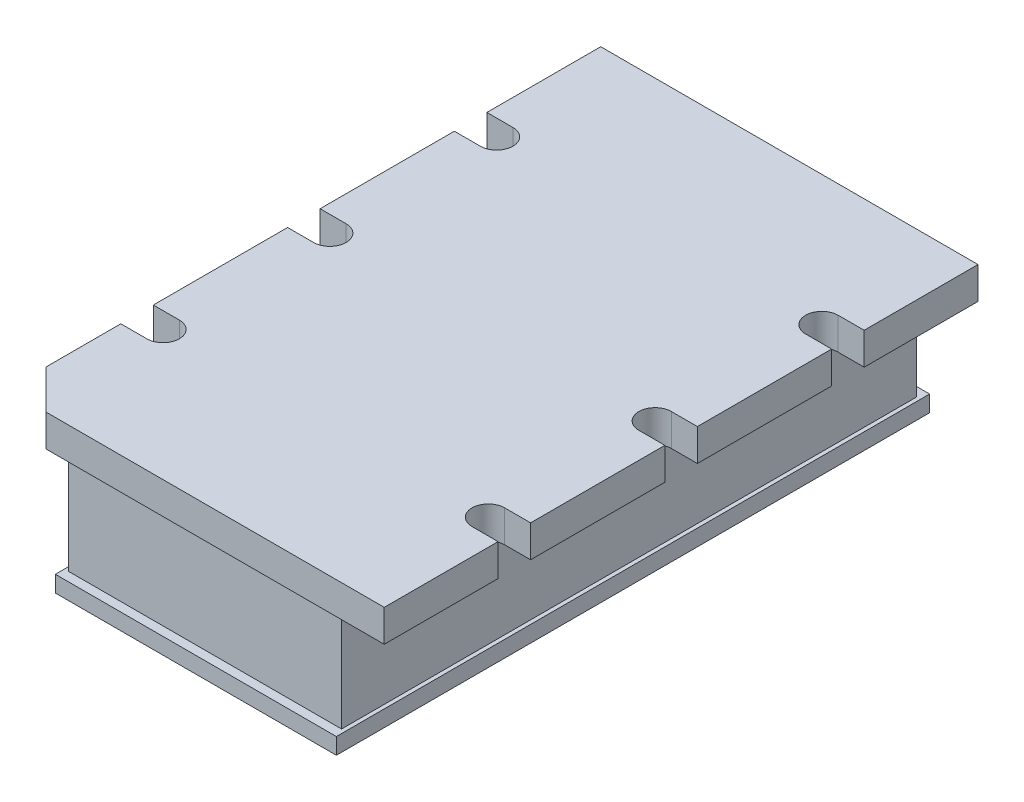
from build123d import *

# Parameters (mm, degrees)
SKETCH1_W            = 36.83
SKETCH1_H            = 57.9628
EXTRUDE1_DEPTH       = 3.1242
EXTRUDE2_DEPTH       = 35.478897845
MIRROR2_COPY_1_DEPTH = 35.478897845
CHAMFER1_SIZE        = 3.81
SKETCH4_W            = 26.67
SKETCH4_H            = 56.134
EXTRUDE4_DEPTH       = 10.16
EXTRUDE5_DEPTH       = 1.5875
EXTRUDE6_DEPTH       = 26.67


with BuildPart() as part:
    # Sketch1 → Extrude1 (new body)
    with BuildSketch(Plane(origin=(0, 0, 0), x_dir=(1, 0, 0), z_dir=(0, 1, 0))):
        Rectangle(SKETCH1_W, SKETCH1_H)
    extrude(amount=EXTRUDE1_DEPTH)

    # Sketch2 → Extrude2 (cut, through all)
    with BuildSketch(Plane.XZ):
        with BuildLine():
            ThreePointArc((-15.875, 14.6939), (-14.2875, 16.2814), (-15.875, 17.8689))
            Line((-15.875, 17.8689), (-18.415, 17.8689))
            Line((-18.415, 17.8689), (-18.415, 14.6939))
            Line((-18.415, 14.6939), (-15.875, 14.6939))
        make_face()
        with BuildLine():
            Line((-15.875, 1.5875), (-18.415, 1.5875))
            Line((-18.415, 1.5875), (-18.415, -1.5875))
            Line((-18.415, -1.5875), (-15.875, -1.5875))
            ThreePointArc((-15.875, -1.5875), (-14.2875, 0), (-15.875, 1.5875))
        make_face()
    extrude2 = extrude(amount=-EXTRUDE2_DEPTH, mode=Mode.SUBTRACT)

    # Mirror1: Extrude2 across plane
    add(extrude2.mirror(Plane.XY), mode=Mode.SUBTRACT)

    # Mirror2: Extrude2 across plane
    add(extrude2.mirror(Plane(origin=(0, 0, 0), x_dir=(0, 0, 1), z_dir=(1, 0, 0))), mode=Mode.SUBTRACT)

    # Mirror2 copy 1 sketch → Mirror2 copy 1 (cut, through all)
    with BuildSketch(Plane(origin=(0, 0, 0), x_dir=(-1, 0, 0), z_dir=(0, -1, 0))):
        with BuildLine():
            ThreePointArc((-15.875, 14.6939), (-14.2875, 16.2814), (-15.875, 17.8689))
            Line((-15.875, 17.8689), (-18.415, 17.8689))
            Line((-18.415, 17.8689), (-18.415, 14.6939))
            Line((-18.415, 14.6939), (-15.875, 14.6939))
        make_face()
        with BuildLine():
            Line((-15.875, 1.5875), (-18.415, 1.5875))
            Line((-18.415, 1.5875), (-18.415, -1.5875))
            Line((-18.415, -1.5875), (-15.875, -1.5875))
            ThreePointArc((-15.875, -1.5875), (-14.2875, 0), (-15.875, 1.5875))
        make_face()
    extrude(amount=-MIRROR2_COPY_1_DEPTH, mode=Mode.SUBTRACT)

    # Chamfer1
    chamfer1_edges = [part.edges().sort_by_distance(p)[0] for p in [
        (-18.415, 1.5621, 28.9814),
    ]]
    chamfer(chamfer1_edges, length=CHAMFER1_SIZE)

    # Sketch4 → Extrude4 (add)
    with BuildSketch(Plane.XZ):
        Rectangle(SKETCH4_W, SKETCH4_H)
    extrude(amount=EXTRUDE4_DEPTH)

    # Sketch3 → Extrude5 (add)
    with BuildSketch(Plane.XZ.offset(10.16)):
        Polygon((-13.716, 13.716), (-18.6436, 13.716), (-18.6436, -13.716), (-13.716, -13.716), (-13.716, -28.956), (13.716, -28.956), (13.716, 28.956), (-13.716, 28.956), align=None)
    extrude(amount=EXTRUDE5_DEPTH)

    # Sketch6 → Extrude6 (add)
    with BuildSketch(Plane(origin=(0, 0, -13.716), x_dir=(-1, 0, 0), z_dir=(0, 0, -1))):
        Polygon((18.796, -11.7475), (18.796, -17.5895), (18.384422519, -17.5895), (16.940101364, -20.2565), (13.384101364, -20.2565), (12.7, -14.7193), (12.7, -11.7475), align=None)
    extrude(amount=-EXTRUDE6_DEPTH)


solid = part.part
